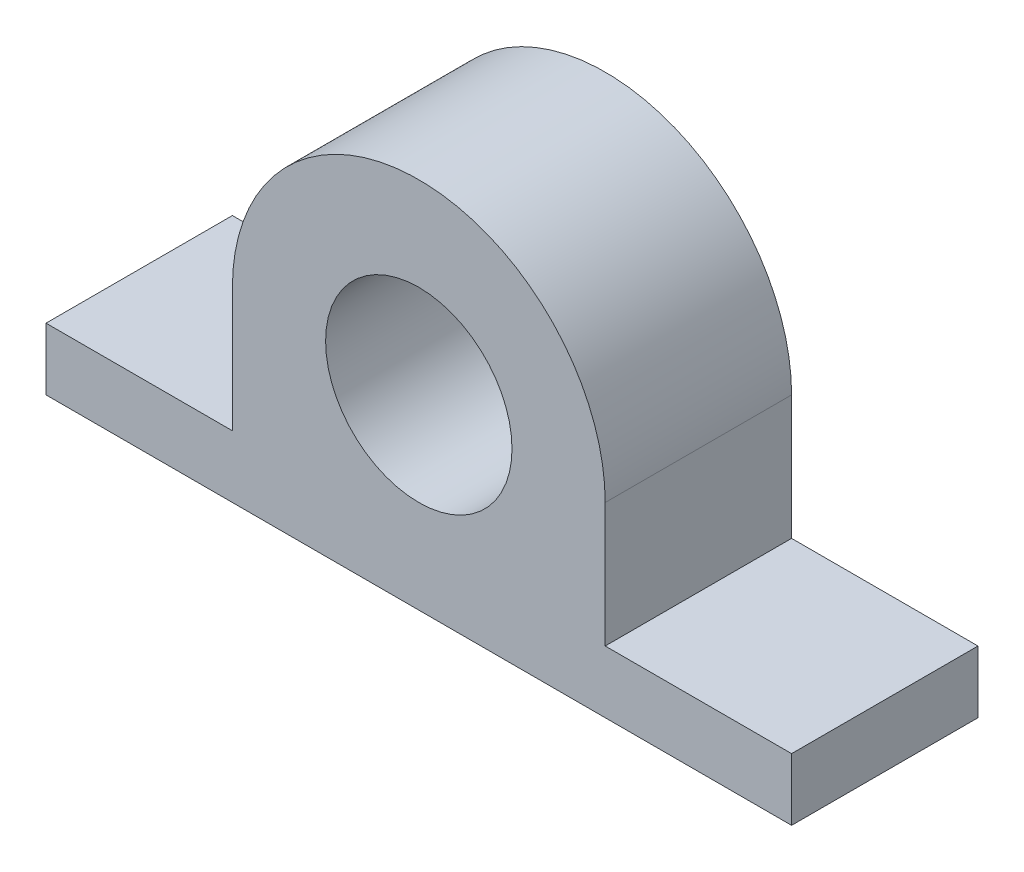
ISO-10303-21;
HEADER;
FILE_DESCRIPTION(('STEP AP214'),'2;1');
FILE_NAME('part.step','',(''),(''),'','','');
FILE_SCHEMA(('AUTOMOTIVE_DESIGN { 1 0 10303 214 1 1 1 1 }'));
ENDSEC;
DATA;
#1=APPLICATION_CONTEXT('core data for automotive mechanical design processes');
#2=APPLICATION_PROTOCOL_DEFINITION('international standard','automotive_design',2000,#1);
#3=PRODUCT_CONTEXT('',#1,'mechanical');
#4=PRODUCT('Part','Part','',(#3));
#5=PRODUCT_RELATED_PRODUCT_CATEGORY('part','',(#4));
#6=PRODUCT_DEFINITION_FORMATION('','',#4);
#7=PRODUCT_DEFINITION_CONTEXT('part definition',#1,'design');
#8=PRODUCT_DEFINITION('design','',#6,#7);
#9=PRODUCT_DEFINITION_SHAPE('','',#8);
#10=(LENGTH_UNIT() NAMED_UNIT(*) SI_UNIT(.MILLI.,.METRE.));
#11=(NAMED_UNIT(*) PLANE_ANGLE_UNIT() SI_UNIT($,.RADIAN.));
#12=(NAMED_UNIT(*) SI_UNIT($,.STERADIAN.) SOLID_ANGLE_UNIT());
#13=UNCERTAINTY_MEASURE_WITH_UNIT(LENGTH_MEASURE(1.E-05),#10,'distance_accuracy_value','');
#14=(GEOMETRIC_REPRESENTATION_CONTEXT(3) GLOBAL_UNCERTAINTY_ASSIGNED_CONTEXT((#13)) GLOBAL_UNIT_ASSIGNED_CONTEXT((#10,
#11,#12)) REPRESENTATION_CONTEXT('',''));
#15=CARTESIAN_POINT('',(0.,0.,0.));
#16=DIRECTION('',(0.,0.,1.));
#17=DIRECTION('',(1.,0.,0.));
#18=AXIS2_PLACEMENT_3D('',#15,#16,#17);
#19=CARTESIAN_POINT('',(70.,40.,30.));
#20=DIRECTION('',(0.,0.,1.));
#21=DIRECTION('',(1.,0.,0.));
#22=AXIS2_PLACEMENT_3D('',#19,#20,#21);
#23=PLANE('',#22);
#24=DIRECTION('',(0.,-1.,0.));
#25=VECTOR('',#24,1.);
#26=CARTESIAN_POINT('',(40.,40.,30.));
#27=LINE('',#26,#25);
#28=CARTESIAN_POINT('',(40.,40.,30.));
#29=VERTEX_POINT('',#28);
#30=CARTESIAN_POINT('',(40.,20.,30.));
#31=VERTEX_POINT('',#30);
#32=EDGE_CURVE('E192',#29,#31,#27,.T.);
#33=ORIENTED_EDGE('',*,*,#32,.T.);
#34=DIRECTION('',(-1.,0.,0.));
#35=VECTOR('',#34,1.);
#36=CARTESIAN_POINT('',(40.,20.,30.));
#37=LINE('',#36,#35);
#38=CARTESIAN_POINT('',(10.,20.,30.));
#39=VERTEX_POINT('',#38);
#40=EDGE_CURVE('E127',#31,#39,#37,.T.);
#41=ORIENTED_EDGE('',*,*,#40,.T.);
#42=DIRECTION('',(0.,-1.,0.));
#43=VECTOR('',#42,1.);
#44=CARTESIAN_POINT('',(10.,20.,30.));
#45=LINE('',#44,#43);
#46=CARTESIAN_POINT('',(10.,10.,30.));
#47=VERTEX_POINT('',#46);
#48=EDGE_CURVE('E214',#39,#47,#45,.T.);
#49=ORIENTED_EDGE('',*,*,#48,.T.);
#50=DIRECTION('',(1.,0.,0.));
#51=VECTOR('',#50,1.);
#52=CARTESIAN_POINT('',(10.,10.,30.));
#53=LINE('',#52,#51);
#54=CARTESIAN_POINT('',(130.,10.,30.));
#55=VERTEX_POINT('',#54);
#56=EDGE_CURVE('E228',#47,#55,#53,.T.);
#57=ORIENTED_EDGE('',*,*,#56,.T.);
#58=DIRECTION('',(0.,1.,0.));
#59=VECTOR('',#58,1.);
#60=CARTESIAN_POINT('',(130.,10.,30.));
#61=LINE('',#60,#59);
#62=CARTESIAN_POINT('',(130.,20.,30.));
#63=VERTEX_POINT('',#62);
#64=EDGE_CURVE('E146',#55,#63,#61,.T.);
#65=ORIENTED_EDGE('',*,*,#64,.T.);
#66=DIRECTION('',(-1.,0.,0.));
#67=VECTOR('',#66,1.);
#68=CARTESIAN_POINT('',(130.,20.,30.));
#69=LINE('',#68,#67);
#70=CARTESIAN_POINT('',(100.,20.,30.));
#71=VERTEX_POINT('',#70);
#72=EDGE_CURVE('E140',#63,#71,#69,.T.);
#73=ORIENTED_EDGE('',*,*,#72,.T.);
#74=DIRECTION('',(0.,1.,0.));
#75=VECTOR('',#74,1.);
#76=CARTESIAN_POINT('',(100.,20.,30.));
#77=LINE('',#76,#75);
#78=CARTESIAN_POINT('',(100.,40.,30.));
#79=VERTEX_POINT('',#78);
#80=EDGE_CURVE('E144',#71,#79,#77,.T.);
#81=ORIENTED_EDGE('',*,*,#80,.T.);
#82=CARTESIAN_POINT('',(70.,40.,30.));
#83=DIRECTION('',(0.,0.,1.));
#84=DIRECTION('',(1.,0.,0.));
#85=AXIS2_PLACEMENT_3D('',#82,#83,#84);
#86=CIRCLE('',#85,30.);
#87=EDGE_CURVE('E84',#79,#29,#86,.T.);
#88=ORIENTED_EDGE('',*,*,#87,.T.);
#89=EDGE_LOOP('',(#33,#41,#49,#57,#65,#73,#81,#88));
#90=FACE_BOUND('',#89,.T.);
#91=CARTESIAN_POINT('',(70.,40.,30.));
#92=DIRECTION('',(0.,0.,1.));
#93=DIRECTION('',(1.,0.,0.));
#94=AXIS2_PLACEMENT_3D('',#91,#92,#93);
#95=CIRCLE('',#94,15.);
#96=CARTESIAN_POINT('',(85.,40.,30.));
#97=VERTEX_POINT('',#96);
#98=EDGE_CURVE('E174',#97,#97,#95,.T.);
#99=ORIENTED_EDGE('',*,*,#98,.F.);
#100=EDGE_LOOP('',(#99));
#101=FACE_BOUND('',#100,.T.);
#102=ADVANCED_FACE('F66',(#90,#101),#23,.T.);
#103=CARTESIAN_POINT('',(70.,40.,0.));
#104=DIRECTION('',(0.,0.,1.));
#105=DIRECTION('',(1.,0.,0.));
#106=AXIS2_PLACEMENT_3D('',#103,#104,#105);
#107=PLANE('',#106);
#108=DIRECTION('',(0.,-1.,0.));
#109=VECTOR('',#108,1.);
#110=CARTESIAN_POINT('',(40.,40.,0.));
#111=LINE('',#110,#109);
#112=CARTESIAN_POINT('',(40.,40.,0.));
#113=VERTEX_POINT('',#112);
#114=CARTESIAN_POINT('',(40.,20.,0.));
#115=VERTEX_POINT('',#114);
#116=EDGE_CURVE('E169',#113,#115,#111,.T.);
#117=ORIENTED_EDGE('',*,*,#116,.F.);
#118=CARTESIAN_POINT('',(70.,40.,0.));
#119=DIRECTION('',(0.,0.,1.));
#120=DIRECTION('',(1.,0.,0.));
#121=AXIS2_PLACEMENT_3D('',#118,#119,#120);
#122=CIRCLE('',#121,30.);
#123=CARTESIAN_POINT('',(100.,40.,0.));
#124=VERTEX_POINT('',#123);
#125=EDGE_CURVE('E119',#124,#113,#122,.T.);
#126=ORIENTED_EDGE('',*,*,#125,.F.);
#127=DIRECTION('',(0.,1.,0.));
#128=VECTOR('',#127,1.);
#129=CARTESIAN_POINT('',(100.,20.,0.));
#130=LINE('',#129,#128);
#131=CARTESIAN_POINT('',(100.,20.,0.));
#132=VERTEX_POINT('',#131);
#133=EDGE_CURVE('E113',#132,#124,#130,.T.);
#134=ORIENTED_EDGE('',*,*,#133,.F.);
#135=DIRECTION('',(-1.,0.,0.));
#136=VECTOR('',#135,1.);
#137=CARTESIAN_POINT('',(130.,20.,0.));
#138=LINE('',#137,#136);
#139=CARTESIAN_POINT('',(130.,20.,0.));
#140=VERTEX_POINT('',#139);
#141=EDGE_CURVE('E155',#140,#132,#138,.T.);
#142=ORIENTED_EDGE('',*,*,#141,.F.);
#143=DIRECTION('',(0.,1.,0.));
#144=VECTOR('',#143,1.);
#145=CARTESIAN_POINT('',(130.,10.,0.));
#146=LINE('',#145,#144);
#147=CARTESIAN_POINT('',(130.,10.,0.));
#148=VERTEX_POINT('',#147);
#149=EDGE_CURVE('E183',#148,#140,#146,.T.);
#150=ORIENTED_EDGE('',*,*,#149,.F.);
#151=DIRECTION('',(1.,0.,0.));
#152=VECTOR('',#151,1.);
#153=CARTESIAN_POINT('',(10.,10.,0.));
#154=LINE('',#153,#152);
#155=CARTESIAN_POINT('',(10.,10.,0.));
#156=VERTEX_POINT('',#155);
#157=EDGE_CURVE('E180',#156,#148,#154,.T.);
#158=ORIENTED_EDGE('',*,*,#157,.F.);
#159=DIRECTION('',(0.,-1.,0.));
#160=VECTOR('',#159,1.);
#161=CARTESIAN_POINT('',(10.,20.,0.));
#162=LINE('',#161,#160);
#163=CARTESIAN_POINT('',(10.,20.,0.));
#164=VERTEX_POINT('',#163);
#165=EDGE_CURVE('E177',#164,#156,#162,.T.);
#166=ORIENTED_EDGE('',*,*,#165,.F.);
#167=DIRECTION('',(-1.,0.,0.));
#168=VECTOR('',#167,1.);
#169=CARTESIAN_POINT('',(40.,20.,0.));
#170=LINE('',#169,#168);
#171=EDGE_CURVE('E173',#115,#164,#170,.T.);
#172=ORIENTED_EDGE('',*,*,#171,.F.);
#173=EDGE_LOOP('',(#117,#126,#134,#142,#150,#158,#166,#172));
#174=FACE_BOUND('',#173,.T.);
#175=CARTESIAN_POINT('',(70.,40.,0.));
#176=DIRECTION('',(0.,0.,1.));
#177=DIRECTION('',(1.,0.,0.));
#178=AXIS2_PLACEMENT_3D('',#175,#176,#177);
#179=CIRCLE('',#178,15.);
#180=CARTESIAN_POINT('',(85.,40.,0.));
#181=VERTEX_POINT('',#180);
#182=EDGE_CURVE('E239',#181,#181,#179,.T.);
#183=ORIENTED_EDGE('',*,*,#182,.T.);
#184=EDGE_LOOP('',(#183));
#185=FACE_BOUND('',#184,.T.);
#186=ADVANCED_FACE('F218',(#174,#185),#107,.F.);
#187=CARTESIAN_POINT('',(40.,40.,30.));
#188=DIRECTION('',(1.,0.,0.));
#189=DIRECTION('',(0.,0.,-1.));
#190=AXIS2_PLACEMENT_3D('',#187,#188,#189);
#191=PLANE('',#190);
#192=ORIENTED_EDGE('',*,*,#116,.T.);
#193=DIRECTION('',(0.,0.,-1.));
#194=VECTOR('',#193,1.);
#195=CARTESIAN_POINT('',(40.,20.,30.));
#196=LINE('',#195,#194);
#197=EDGE_CURVE('E12',#31,#115,#196,.T.);
#198=ORIENTED_EDGE('',*,*,#197,.F.);
#199=ORIENTED_EDGE('',*,*,#32,.F.);
#200=DIRECTION('',(0.,0.,-1.));
#201=VECTOR('',#200,1.);
#202=CARTESIAN_POINT('',(40.,40.,30.));
#203=LINE('',#202,#201);
#204=EDGE_CURVE('E165',#29,#113,#203,.T.);
#205=ORIENTED_EDGE('',*,*,#204,.T.);
#206=EDGE_LOOP('',(#192,#198,#199,#205));
#207=FACE_BOUND('',#206,.T.);
#208=ADVANCED_FACE('F68',(#207),#191,.F.);
#209=CARTESIAN_POINT('',(40.,20.,30.));
#210=DIRECTION('',(0.,-1.,0.));
#211=DIRECTION('',(1.,0.,0.));
#212=AXIS2_PLACEMENT_3D('',#209,#210,#211);
#213=PLANE('',#212);
#214=ORIENTED_EDGE('',*,*,#171,.T.);
#215=DIRECTION('',(0.,0.,-1.));
#216=VECTOR('',#215,1.);
#217=CARTESIAN_POINT('',(10.,20.,30.));
#218=LINE('',#217,#216);
#219=EDGE_CURVE('E76',#39,#164,#218,.T.);
#220=ORIENTED_EDGE('',*,*,#219,.F.);
#221=ORIENTED_EDGE('',*,*,#40,.F.);
#222=ORIENTED_EDGE('',*,*,#197,.T.);
#223=EDGE_LOOP('',(#214,#220,#221,#222));
#224=FACE_BOUND('',#223,.T.);
#225=ADVANCED_FACE('F270',(#224),#213,.F.);
#226=CARTESIAN_POINT('',(10.,20.,30.));
#227=DIRECTION('',(1.,0.,0.));
#228=DIRECTION('',(0.,1.,0.));
#229=AXIS2_PLACEMENT_3D('',#226,#227,#228);
#230=PLANE('',#229);
#231=ORIENTED_EDGE('',*,*,#165,.T.);
#232=DIRECTION('',(0.,0.,-1.));
#233=VECTOR('',#232,1.);
#234=CARTESIAN_POINT('',(10.,10.,30.));
#235=LINE('',#234,#233);
#236=EDGE_CURVE('E203',#47,#156,#235,.T.);
#237=ORIENTED_EDGE('',*,*,#236,.F.);
#238=ORIENTED_EDGE('',*,*,#48,.F.);
#239=ORIENTED_EDGE('',*,*,#219,.T.);
#240=EDGE_LOOP('',(#231,#237,#238,#239));
#241=FACE_BOUND('',#240,.T.);
#242=ADVANCED_FACE('F212',(#241),#230,.F.);
#243=CARTESIAN_POINT('',(10.,10.,30.));
#244=DIRECTION('',(0.,1.,0.));
#245=DIRECTION('',(0.,0.,1.));
#246=AXIS2_PLACEMENT_3D('',#243,#244,#245);
#247=PLANE('',#246);
#248=ORIENTED_EDGE('',*,*,#157,.T.);
#249=DIRECTION('',(0.,0.,-1.));
#250=VECTOR('',#249,1.);
#251=CARTESIAN_POINT('',(130.,10.,30.));
#252=LINE('',#251,#250);
#253=EDGE_CURVE('E199',#55,#148,#252,.T.);
#254=ORIENTED_EDGE('',*,*,#253,.F.);
#255=ORIENTED_EDGE('',*,*,#56,.F.);
#256=ORIENTED_EDGE('',*,*,#236,.T.);
#257=EDGE_LOOP('',(#248,#254,#255,#256));
#258=FACE_BOUND('',#257,.T.);
#259=ADVANCED_FACE('F223',(#258),#247,.F.);
#260=CARTESIAN_POINT('',(130.,10.,30.));
#261=DIRECTION('',(-1.,0.,0.));
#262=DIRECTION('',(0.,0.,1.));
#263=AXIS2_PLACEMENT_3D('',#260,#261,#262);
#264=PLANE('',#263);
#265=ORIENTED_EDGE('',*,*,#149,.T.);
#266=DIRECTION('',(0.,0.,-1.));
#267=VECTOR('',#266,1.);
#268=CARTESIAN_POINT('',(130.,20.,30.));
#269=LINE('',#268,#267);
#270=EDGE_CURVE('E157',#63,#140,#269,.T.);
#271=ORIENTED_EDGE('',*,*,#270,.F.);
#272=ORIENTED_EDGE('',*,*,#64,.F.);
#273=ORIENTED_EDGE('',*,*,#253,.T.);
#274=EDGE_LOOP('',(#265,#271,#272,#273));
#275=FACE_BOUND('',#274,.T.);
#276=ADVANCED_FACE('F226',(#275),#264,.F.);
#277=CARTESIAN_POINT('',(130.,20.,30.));
#278=DIRECTION('',(0.,-1.,0.));
#279=DIRECTION('',(1.,0.,0.));
#280=AXIS2_PLACEMENT_3D('',#277,#278,#279);
#281=PLANE('',#280);
#282=ORIENTED_EDGE('',*,*,#141,.T.);
#283=DIRECTION('',(0.,0.,-1.));
#284=VECTOR('',#283,1.);
#285=CARTESIAN_POINT('',(100.,20.,30.));
#286=LINE('',#285,#284);
#287=EDGE_CURVE('E152',#71,#132,#286,.T.);
#288=ORIENTED_EDGE('',*,*,#287,.F.);
#289=ORIENTED_EDGE('',*,*,#72,.F.);
#290=ORIENTED_EDGE('',*,*,#270,.T.);
#291=EDGE_LOOP('',(#282,#288,#289,#290));
#292=FACE_BOUND('',#291,.T.);
#293=ADVANCED_FACE('F153',(#292),#281,.F.);
#294=CARTESIAN_POINT('',(100.,20.,30.));
#295=DIRECTION('',(-1.,0.,0.));
#296=DIRECTION('',(0.,-1.,0.));
#297=AXIS2_PLACEMENT_3D('',#294,#295,#296);
#298=PLANE('',#297);
#299=ORIENTED_EDGE('',*,*,#133,.T.);
#300=DIRECTION('',(0.,0.,-1.));
#301=VECTOR('',#300,1.);
#302=CARTESIAN_POINT('',(100.,40.,30.));
#303=LINE('',#302,#301);
#304=EDGE_CURVE('E158',#79,#124,#303,.T.);
#305=ORIENTED_EDGE('',*,*,#304,.F.);
#306=ORIENTED_EDGE('',*,*,#80,.F.);
#307=ORIENTED_EDGE('',*,*,#287,.T.);
#308=EDGE_LOOP('',(#299,#305,#306,#307));
#309=FACE_BOUND('',#308,.T.);
#310=ADVANCED_FACE('F160',(#309),#298,.F.);
#311=CARTESIAN_POINT('',(70.,40.,30.));
#312=DIRECTION('',(0.,0.,-1.));
#313=DIRECTION('',(-1.,0.,0.));
#314=AXIS2_PLACEMENT_3D('',#311,#312,#313);
#315=CYLINDRICAL_SURFACE('',#314,30.);
#316=ORIENTED_EDGE('',*,*,#125,.T.);
#317=ORIENTED_EDGE('',*,*,#204,.F.);
#318=ORIENTED_EDGE('',*,*,#87,.F.);
#319=ORIENTED_EDGE('',*,*,#304,.T.);
#320=EDGE_LOOP('',(#316,#317,#318,#319));
#321=FACE_BOUND('',#320,.T.);
#322=ADVANCED_FACE('F258',(#321),#315,.T.);
#323=CARTESIAN_POINT('',(70.,40.,30.));
#324=DIRECTION('',(0.,0.,-1.));
#325=DIRECTION('',(-1.,0.,0.));
#326=AXIS2_PLACEMENT_3D('',#323,#324,#325);
#327=CYLINDRICAL_SURFACE('',#326,15.);
#328=ORIENTED_EDGE('',*,*,#98,.T.);
#329=EDGE_LOOP('',(#328));
#330=FACE_BOUND('',#329,.T.);
#331=ORIENTED_EDGE('',*,*,#182,.F.);
#332=EDGE_LOOP('',(#331));
#333=FACE_BOUND('',#332,.T.);
#334=ADVANCED_FACE('F248',(#330,#333),#327,.F.);
#335=CLOSED_SHELL('',(#102,#186,#208,#225,#242,#259,#276,#293,#310,#322,#334));
#336=MANIFOLD_SOLID_BREP('B2',#335);
#337=ADVANCED_BREP_SHAPE_REPRESENTATION('',(#18,#336),#14);
#338=SHAPE_DEFINITION_REPRESENTATION(#9,#337);
ENDSEC;
END-ISO-10303-21;
